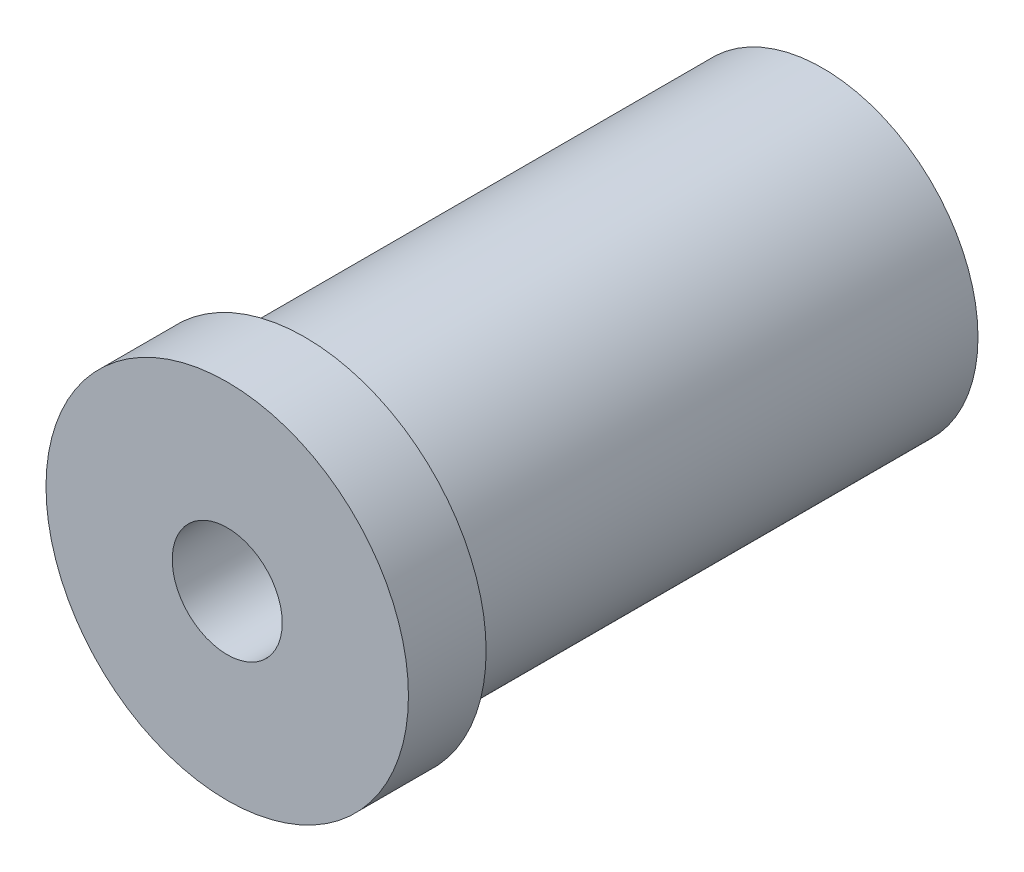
ISO-10303-21;
HEADER;
FILE_DESCRIPTION(('STEP AP214'),'2;1');
FILE_NAME('part.step','',(''),(''),'','','');
FILE_SCHEMA(('AUTOMOTIVE_DESIGN { 1 0 10303 214 1 1 1 1 }'));
ENDSEC;
DATA;
#1=APPLICATION_CONTEXT('core data for automotive mechanical design processes');
#2=APPLICATION_PROTOCOL_DEFINITION('international standard','automotive_design',2000,#1);
#3=PRODUCT_CONTEXT('',#1,'mechanical');
#4=PRODUCT('Part','Part','',(#3));
#5=PRODUCT_RELATED_PRODUCT_CATEGORY('part','',(#4));
#6=PRODUCT_DEFINITION_FORMATION('','',#4);
#7=PRODUCT_DEFINITION_CONTEXT('part definition',#1,'design');
#8=PRODUCT_DEFINITION('design','',#6,#7);
#9=PRODUCT_DEFINITION_SHAPE('','',#8);
#10=(LENGTH_UNIT() NAMED_UNIT(*) SI_UNIT(.MILLI.,.METRE.));
#11=(NAMED_UNIT(*) PLANE_ANGLE_UNIT() SI_UNIT($,.RADIAN.));
#12=(NAMED_UNIT(*) SI_UNIT($,.STERADIAN.) SOLID_ANGLE_UNIT());
#13=UNCERTAINTY_MEASURE_WITH_UNIT(LENGTH_MEASURE(1.E-05),#10,'distance_accuracy_value','');
#14=(GEOMETRIC_REPRESENTATION_CONTEXT(3) GLOBAL_UNCERTAINTY_ASSIGNED_CONTEXT((#13)) GLOBAL_UNIT_ASSIGNED_CONTEXT((#10,
#11,#12)) REPRESENTATION_CONTEXT('',''));
#15=CARTESIAN_POINT('',(0.,0.,0.));
#16=DIRECTION('',(0.,0.,1.));
#17=DIRECTION('',(1.,0.,0.));
#18=AXIS2_PLACEMENT_3D('',#15,#16,#17);
#19=CARTESIAN_POINT('',(0.,4.25,-18.));
#20=DIRECTION('',(0.,0.,-1.));
#21=DIRECTION('',(-1.,0.,0.));
#22=AXIS2_PLACEMENT_3D('',#19,#20,#21);
#23=PLANE('',#22);
#24=CARTESIAN_POINT('',(0.,0.,-18.));
#25=DIRECTION('',(0.,0.,1.));
#26=DIRECTION('',(1.,0.,0.));
#27=AXIS2_PLACEMENT_3D('',#24,#25,#26);
#28=CIRCLE('',#27,4.);
#29=CARTESIAN_POINT('',(4.,0.,-18.));
#30=VERTEX_POINT('',#29);
#31=EDGE_CURVE('E51',#30,#30,#28,.T.);
#32=ORIENTED_EDGE('',*,*,#31,.F.);
#33=EDGE_LOOP('',(#32));
#34=FACE_BOUND('',#33,.T.);
#35=CARTESIAN_POINT('',(0.,0.,-18.));
#36=DIRECTION('',(0.,0.,1.));
#37=DIRECTION('',(1.,0.,0.));
#38=AXIS2_PLACEMENT_3D('',#35,#36,#37);
#39=CIRCLE('',#38,4.25);
#40=CARTESIAN_POINT('',(4.25,0.,-18.));
#41=VERTEX_POINT('',#40);
#42=EDGE_CURVE('E9',#41,#41,#39,.T.);
#43=ORIENTED_EDGE('',*,*,#42,.T.);
#44=EDGE_LOOP('',(#43));
#45=FACE_BOUND('',#44,.T.);
#46=ADVANCED_FACE('F14',(#34,#45),#23,.F.);
#47=CARTESIAN_POINT('',(0.,0.,0.));
#48=DIRECTION('',(0.,0.,1.));
#49=DIRECTION('',(1.,0.,0.));
#50=AXIS2_PLACEMENT_3D('',#47,#48,#49);
#51=CYLINDRICAL_SURFACE('',#50,4.25);
#52=ORIENTED_EDGE('',*,*,#42,.F.);
#53=EDGE_LOOP('',(#52));
#54=FACE_BOUND('',#53,.T.);
#55=CARTESIAN_POINT('',(0.,0.,0.));
#56=DIRECTION('',(0.,0.,1.));
#57=DIRECTION('',(1.,0.,0.));
#58=AXIS2_PLACEMENT_3D('',#55,#56,#57);
#59=CIRCLE('',#58,4.25);
#60=CARTESIAN_POINT('',(4.25,0.,0.));
#61=VERTEX_POINT('',#60);
#62=EDGE_CURVE('E20',#61,#61,#59,.T.);
#63=ORIENTED_EDGE('',*,*,#62,.T.);
#64=EDGE_LOOP('',(#63));
#65=FACE_BOUND('',#64,.T.);
#66=ADVANCED_FACE('F58',(#54,#65),#51,.F.);
#67=CARTESIAN_POINT('',(0.,4.25,0.));
#68=DIRECTION('',(0.,0.,-1.));
#69=DIRECTION('',(-1.,0.,0.));
#70=AXIS2_PLACEMENT_3D('',#67,#68,#69);
#71=PLANE('',#70);
#72=ORIENTED_EDGE('',*,*,#62,.F.);
#73=EDGE_LOOP('',(#72));
#74=FACE_BOUND('',#73,.T.);
#75=CARTESIAN_POINT('',(0.,0.,0.));
#76=DIRECTION('',(0.,0.,1.));
#77=DIRECTION('',(1.,0.,0.));
#78=AXIS2_PLACEMENT_3D('',#75,#76,#77);
#79=CIRCLE('',#78,14.);
#80=CARTESIAN_POINT('',(14.,0.,0.));
#81=VERTEX_POINT('',#80);
#82=EDGE_CURVE('E24',#81,#81,#79,.T.);
#83=ORIENTED_EDGE('',*,*,#82,.T.);
#84=EDGE_LOOP('',(#83));
#85=FACE_BOUND('',#84,.T.);
#86=ADVANCED_FACE('F64',(#74,#85),#71,.F.);
#87=CARTESIAN_POINT('',(0.,0.,0.));
#88=DIRECTION('',(0.,0.,1.));
#89=DIRECTION('',(1.,0.,0.));
#90=AXIS2_PLACEMENT_3D('',#87,#88,#89);
#91=CYLINDRICAL_SURFACE('',#90,14.);
#92=ORIENTED_EDGE('',*,*,#82,.F.);
#93=EDGE_LOOP('',(#92));
#94=FACE_BOUND('',#93,.T.);
#95=CARTESIAN_POINT('',(0.,0.,-6.));
#96=DIRECTION('',(0.,0.,1.));
#97=DIRECTION('',(1.,0.,0.));
#98=AXIS2_PLACEMENT_3D('',#95,#96,#97);
#99=CIRCLE('',#98,14.);
#100=CARTESIAN_POINT('',(14.,0.,-6.));
#101=VERTEX_POINT('',#100);
#102=EDGE_CURVE('E28',#101,#101,#99,.T.);
#103=ORIENTED_EDGE('',*,*,#102,.T.);
#104=EDGE_LOOP('',(#103));
#105=FACE_BOUND('',#104,.T.);
#106=ADVANCED_FACE('F70',(#94,#105),#91,.T.);
#107=CARTESIAN_POINT('',(0.,14.,-6.));
#108=DIRECTION('',(0.,0.,1.));
#109=DIRECTION('',(1.,0.,0.));
#110=AXIS2_PLACEMENT_3D('',#107,#108,#109);
#111=PLANE('',#110);
#112=ORIENTED_EDGE('',*,*,#102,.F.);
#113=EDGE_LOOP('',(#112));
#114=FACE_BOUND('',#113,.T.);
#115=CARTESIAN_POINT('',(0.,0.,-6.));
#116=DIRECTION('',(0.,0.,1.));
#117=DIRECTION('',(1.,0.,0.));
#118=AXIS2_PLACEMENT_3D('',#115,#116,#117);
#119=CIRCLE('',#118,12.);
#120=CARTESIAN_POINT('',(12.,0.,-6.));
#121=VERTEX_POINT('',#120);
#122=EDGE_CURVE('E33',#121,#121,#119,.T.);
#123=ORIENTED_EDGE('',*,*,#122,.T.);
#124=EDGE_LOOP('',(#123));
#125=FACE_BOUND('',#124,.T.);
#126=ADVANCED_FACE('F76',(#114,#125),#111,.F.);
#127=CARTESIAN_POINT('',(0.,0.,0.));
#128=DIRECTION('',(0.,0.,1.));
#129=DIRECTION('',(1.,0.,0.));
#130=AXIS2_PLACEMENT_3D('',#127,#128,#129);
#131=CYLINDRICAL_SURFACE('',#130,12.);
#132=ORIENTED_EDGE('',*,*,#122,.F.);
#133=EDGE_LOOP('',(#132));
#134=FACE_BOUND('',#133,.T.);
#135=CARTESIAN_POINT('',(0.,0.,-46.));
#136=DIRECTION('',(0.,0.,1.));
#137=DIRECTION('',(1.,0.,0.));
#138=AXIS2_PLACEMENT_3D('',#135,#136,#137);
#139=CIRCLE('',#138,12.);
#140=CARTESIAN_POINT('',(12.,0.,-46.));
#141=VERTEX_POINT('',#140);
#142=EDGE_CURVE('E36',#141,#141,#139,.T.);
#143=ORIENTED_EDGE('',*,*,#142,.T.);
#144=EDGE_LOOP('',(#143));
#145=FACE_BOUND('',#144,.T.);
#146=ADVANCED_FACE('F80',(#134,#145),#131,.T.);
#147=CARTESIAN_POINT('',(0.,12.,-46.));
#148=DIRECTION('',(0.,0.,1.));
#149=DIRECTION('',(1.,0.,0.));
#150=AXIS2_PLACEMENT_3D('',#147,#148,#149);
#151=PLANE('',#150);
#152=ORIENTED_EDGE('',*,*,#142,.F.);
#153=EDGE_LOOP('',(#152));
#154=FACE_BOUND('',#153,.T.);
#155=CARTESIAN_POINT('',(0.,0.,-46.));
#156=DIRECTION('',(0.,0.,1.));
#157=DIRECTION('',(1.,0.,0.));
#158=AXIS2_PLACEMENT_3D('',#155,#156,#157);
#159=CIRCLE('',#158,4.15);
#160=CARTESIAN_POINT('',(4.15,0.,-46.));
#161=VERTEX_POINT('',#160);
#162=EDGE_CURVE('E39',#161,#161,#159,.T.);
#163=ORIENTED_EDGE('',*,*,#162,.T.);
#164=EDGE_LOOP('',(#163));
#165=FACE_BOUND('',#164,.T.);
#166=ADVANCED_FACE('F84',(#154,#165),#151,.F.);
#167=CARTESIAN_POINT('',(0.,0.,0.));
#168=DIRECTION('',(0.,0.,1.));
#169=DIRECTION('',(1.,0.,0.));
#170=AXIS2_PLACEMENT_3D('',#167,#168,#169);
#171=CYLINDRICAL_SURFACE('',#170,4.15);
#172=ORIENTED_EDGE('',*,*,#162,.F.);
#173=EDGE_LOOP('',(#172));
#174=FACE_BOUND('',#173,.T.);
#175=CARTESIAN_POINT('',(0.,0.,-44.));
#176=DIRECTION('',(0.,0.,1.));
#177=DIRECTION('',(1.,0.,0.));
#178=AXIS2_PLACEMENT_3D('',#175,#176,#177);
#179=CIRCLE('',#178,4.15);
#180=CARTESIAN_POINT('',(4.15,0.,-44.));
#181=VERTEX_POINT('',#180);
#182=EDGE_CURVE('E42',#181,#181,#179,.T.);
#183=ORIENTED_EDGE('',*,*,#182,.T.);
#184=EDGE_LOOP('',(#183));
#185=FACE_BOUND('',#184,.T.);
#186=ADVANCED_FACE('F88',(#174,#185),#171,.F.);
#187=CARTESIAN_POINT('',(0.,0.,-36.5));
#188=DIRECTION('',(0.,0.,1.));
#189=DIRECTION('',(1.,0.,0.));
#190=AXIS2_PLACEMENT_3D('',#187,#188,#189);
#191=CONICAL_SURFACE('',#190,4.80616497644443,0.0872664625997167);
#192=ORIENTED_EDGE('',*,*,#182,.F.);
#193=EDGE_LOOP('',(#192));
#194=FACE_BOUND('',#193,.T.);
#195=CARTESIAN_POINT('',(0.,0.,-36.5));
#196=DIRECTION('',(0.,0.,1.));
#197=DIRECTION('',(1.,0.,0.));
#198=AXIS2_PLACEMENT_3D('',#195,#196,#197);
#199=CIRCLE('',#198,4.80616497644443);
#200=CARTESIAN_POINT('',(4.80616497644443,0.,-36.5));
#201=VERTEX_POINT('',#200);
#202=EDGE_CURVE('E45',#201,#201,#199,.T.);
#203=ORIENTED_EDGE('',*,*,#202,.T.);
#204=EDGE_LOOP('',(#203));
#205=FACE_BOUND('',#204,.T.);
#206=ADVANCED_FACE('F92',(#194,#205),#191,.F.);
#207=CARTESIAN_POINT('',(0.,4.80616497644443,-36.5));
#208=DIRECTION('',(0.,0.,1.));
#209=DIRECTION('',(1.,0.,0.));
#210=AXIS2_PLACEMENT_3D('',#207,#208,#209);
#211=PLANE('',#210);
#212=ORIENTED_EDGE('',*,*,#202,.F.);
#213=EDGE_LOOP('',(#212));
#214=FACE_BOUND('',#213,.T.);
#215=CARTESIAN_POINT('',(0.,0.,-36.5));
#216=DIRECTION('',(0.,0.,1.));
#217=DIRECTION('',(1.,0.,0.));
#218=AXIS2_PLACEMENT_3D('',#215,#216,#217);
#219=CIRCLE('',#218,4.);
#220=CARTESIAN_POINT('',(4.,0.,-36.5));
#221=VERTEX_POINT('',#220);
#222=EDGE_CURVE('E48',#221,#221,#219,.T.);
#223=ORIENTED_EDGE('',*,*,#222,.T.);
#224=EDGE_LOOP('',(#223));
#225=FACE_BOUND('',#224,.T.);
#226=ADVANCED_FACE('F96',(#214,#225),#211,.F.);
#227=CARTESIAN_POINT('',(0.,0.,0.));
#228=DIRECTION('',(0.,0.,1.));
#229=DIRECTION('',(1.,0.,0.));
#230=AXIS2_PLACEMENT_3D('',#227,#228,#229);
#231=CYLINDRICAL_SURFACE('',#230,4.);
#232=ORIENTED_EDGE('',*,*,#222,.F.);
#233=EDGE_LOOP('',(#232));
#234=FACE_BOUND('',#233,.T.);
#235=ORIENTED_EDGE('',*,*,#31,.T.);
#236=EDGE_LOOP('',(#235));
#237=FACE_BOUND('',#236,.T.);
#238=ADVANCED_FACE('F55',(#234,#237),#231,.F.);
#239=CLOSED_SHELL('',(#46,#66,#86,#106,#126,#146,#166,#186,#206,#226,#238));
#240=MANIFOLD_SOLID_BREP('B1',#239);
#241=ADVANCED_BREP_SHAPE_REPRESENTATION('',(#18,#240),#14);
#242=SHAPE_DEFINITION_REPRESENTATION(#9,#241);
ENDSEC;
END-ISO-10303-21;
